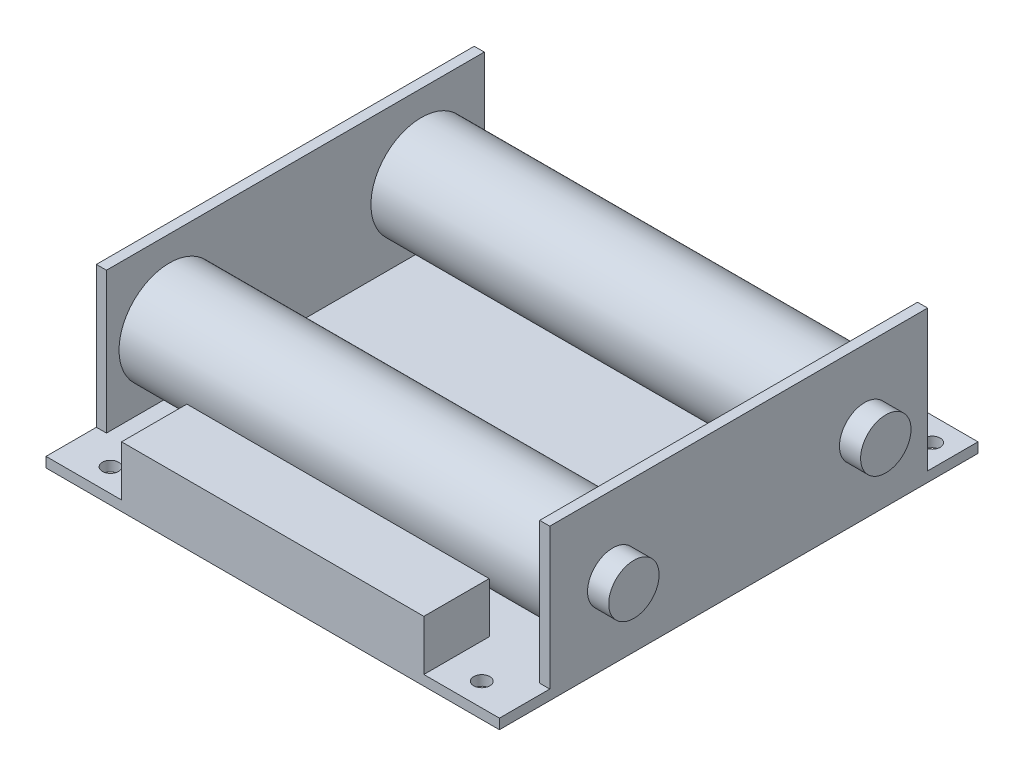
from build123d import *

# Parameters (mm, degrees)
SKETCH1_W                  = 90
SKETCH1_H                  = 95
BOSS_EXTRUDE1_DEPTH        = 2
F_3_2_3_2_DIAMETER_HOLE1_D = 3.2
SKETCH4_W                  = 75
SKETCH4_H                  = 30
BOSS_EXTRUDE2_DEPTH        = 2
BOSS_EXTRUDE3_DEPTH        = 4.2
BOSS_EXTRUDE3_DEPTH_BACK   = 94.2
SKETCH5_R                  = 5
SKETCH6_W                  = 60
SKETCH6_H                  = 13
BOSS_EXTRUDE4_DEPTH        = 10


with BuildPart() as part:
    # Sketch1 → Boss-Extrude1 (new body)
    with BuildSketch(Plane(origin=(0, 0, 0), x_dir=(1, 0, 0), z_dir=(0, 1, 0))):
        Rectangle(SKETCH1_W, SKETCH1_H)
    extrude(amount=BOSS_EXTRUDE1_DEPTH)

    # 3.2 _3.2_ Diameter Hole1 (through all)
    with Locations(Plane(origin=(0, 0, 0), x_dir=(-1, 0, 0), z_dir=(0, -1, 0))):
        with Locations((36.8, -42.9), (-36.9, -42.9), (-40.6, 42.8), (39.4, 42.8)):
            Hole(F_3_2_3_2_DIAMETER_HOLE1_D / 2)

    # Sketch4 → Boss-Extrude2 (add)
    with BuildSketch(Plane(origin=(45, 0, 0), x_dir=(0, 0, -1), z_dir=(1, 0, 0))):
        with Locations((0, 15)):
            Rectangle(SKETCH4_W, SKETCH4_H)
    boss_extrude2 = extrude(amount=-BOSS_EXTRUDE2_DEPTH)

    # Mirror1: Boss-Extrude2 across plane
    add(boss_extrude2.mirror(Plane(origin=(0, 0, 0), x_dir=(0, 0, 1), z_dir=(1, 0, 0))))

    # Sketch5 → Boss-Extrude3 (add, two sides: drawn at the far end of the back side and taken through both)
    with BuildSketch(Plane(origin=(45, 0, 0), x_dir=(0, 0, -1), z_dir=(1, 0, 0)).offset(-BOSS_EXTRUDE3_DEPTH_BACK)):
        with Locations((-25, 15)):
            Circle(SKETCH5_R)
        with Locations((25, 15)):
            Circle(SKETCH5_R)
    extrude(amount=BOSS_EXTRUDE3_DEPTH + BOSS_EXTRUDE3_DEPTH_BACK)

    # Sketch6 → Boss-Extrude4 (add)
    with BuildSketch(Plane(origin=(0, 2, 0), x_dir=(1, 0, 0), z_dir=(0, 1, 0))):
        with Locations((0, -41)):
            Rectangle(SKETCH6_W, SKETCH6_H)
    extrude(amount=BOSS_EXTRUDE4_DEPTH)


solid = part.part
